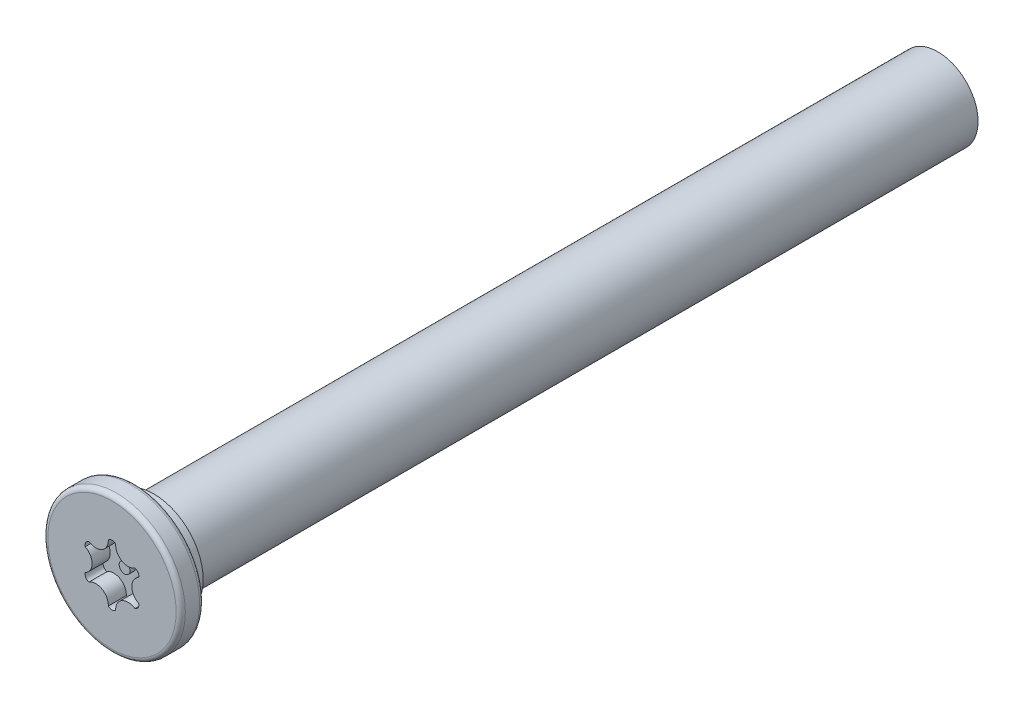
ISO-10303-21;
HEADER;
FILE_DESCRIPTION(('STEP AP214'),'2;1');
FILE_NAME('part.step','',(''),(''),'','','');
FILE_SCHEMA(('AUTOMOTIVE_DESIGN { 1 0 10303 214 1 1 1 1 }'));
ENDSEC;
DATA;
#1=APPLICATION_CONTEXT('core data for automotive mechanical design processes');
#2=APPLICATION_PROTOCOL_DEFINITION('international standard','automotive_design',2000,#1);
#3=PRODUCT_CONTEXT('',#1,'mechanical');
#4=PRODUCT('Part','Part','',(#3));
#5=PRODUCT_RELATED_PRODUCT_CATEGORY('part','',(#4));
#6=PRODUCT_DEFINITION_FORMATION('','',#4);
#7=PRODUCT_DEFINITION_CONTEXT('part definition',#1,'design');
#8=PRODUCT_DEFINITION('design','',#6,#7);
#9=PRODUCT_DEFINITION_SHAPE('','',#8);
#10=(LENGTH_UNIT() NAMED_UNIT(*) SI_UNIT(.MILLI.,.METRE.));
#11=(NAMED_UNIT(*) PLANE_ANGLE_UNIT() SI_UNIT($,.RADIAN.));
#12=(NAMED_UNIT(*) SI_UNIT($,.STERADIAN.) SOLID_ANGLE_UNIT());
#13=UNCERTAINTY_MEASURE_WITH_UNIT(LENGTH_MEASURE(1.E-05),#10,'distance_accuracy_value','');
#14=(GEOMETRIC_REPRESENTATION_CONTEXT(3) GLOBAL_UNCERTAINTY_ASSIGNED_CONTEXT((#13)) GLOBAL_UNIT_ASSIGNED_CONTEXT((#10,
#11,#12)) REPRESENTATION_CONTEXT('',''));
#15=CARTESIAN_POINT('',(0.,0.,0.));
#16=DIRECTION('',(0.,0.,1.));
#17=DIRECTION('',(1.,0.,0.));
#18=AXIS2_PLACEMENT_3D('',#15,#16,#17);
#19=CARTESIAN_POINT('',(0.,0.,0.));
#20=DIRECTION('',(0.,0.,1.));
#21=DIRECTION('',(1.,0.,0.));
#22=AXIS2_PLACEMENT_3D('',#19,#20,#21);
#23=PLANE('',#22);
#24=CARTESIAN_POINT('',(0.,0.,0.));
#25=DIRECTION('',(0.,0.,1.));
#26=DIRECTION('',(1.,0.,0.));
#27=AXIS2_PLACEMENT_3D('',#24,#25,#26);
#28=CIRCLE('',#27,3.55599999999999);
#29=CARTESIAN_POINT('',(3.55599999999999,0.,0.));
#30=VERTEX_POINT('',#29);
#31=EDGE_CURVE('E54',#30,#30,#28,.T.);
#32=ORIENTED_EDGE('',*,*,#31,.T.);
#33=EDGE_LOOP('',(#32));
#34=FACE_BOUND('',#33,.T.);
#35=CARTESIAN_POINT('',(0.893828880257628,1.54815703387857,0.));
#36=DIRECTION('',(0.,0.,1.));
#37=DIRECTION('',(1.,0.,0.));
#38=AXIS2_PLACEMENT_3D('',#35,#36,#37);
#39=CIRCLE('',#38,0.69);
#40=CARTESIAN_POINT('',(0.205060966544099,1.58937306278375,0.));
#41=VERTEX_POINT('',#40);
#42=CARTESIAN_POINT('',(1.27390696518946,0.972274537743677,0.));
#43=VERTEX_POINT('',#42);
#44=EDGE_CURVE('E181',#41,#43,#39,.T.);
#45=ORIENTED_EDGE('',*,*,#44,.T.);
#46=CARTESIAN_POINT('',(1.19884944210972,0.692156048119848,0.));
#47=DIRECTION('',(0.,0.,1.));
#48=DIRECTION('',(1.,0.,0.));
#49=AXIS2_PLACEMENT_3D('',#46,#47,#48);
#50=CIRCLE('',#49,0.29);
#51=CARTESIAN_POINT('',(1.47896793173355,0.617098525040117,0.));
#52=VERTEX_POINT('',#51);
#53=EDGE_CURVE('E61',#43,#52,#50,.F.);
#54=ORIENTED_EDGE('',*,*,#53,.T.);
#55=CARTESIAN_POINT('',(1.78765776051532,0.,0.));
#56=DIRECTION('',(0.,0.,1.));
#57=DIRECTION('',(1.,0.,0.));
#58=AXIS2_PLACEMENT_3D('',#55,#56,#57);
#59=CIRCLE('',#58,0.69);
#60=CARTESIAN_POINT('',(1.47896793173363,-0.617098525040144,0.));
#61=VERTEX_POINT('',#60);
#62=EDGE_CURVE('E111',#52,#61,#59,.T.);
#63=ORIENTED_EDGE('',*,*,#62,.T.);
#64=CARTESIAN_POINT('',(1.1988494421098,-0.692156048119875,0.));
#65=DIRECTION('',(0.,0.,1.));
#66=DIRECTION('',(1.,0.,0.));
#67=AXIS2_PLACEMENT_3D('',#64,#65,#66);
#68=CIRCLE('',#67,0.29);
#69=CARTESIAN_POINT('',(1.27390696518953,-0.972274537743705,0.));
#70=VERTEX_POINT('',#69);
#71=EDGE_CURVE('E216',#61,#70,#68,.F.);
#72=ORIENTED_EDGE('',*,*,#71,.T.);
#73=CARTESIAN_POINT('',(0.893828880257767,-1.54815703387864,0.));
#74=DIRECTION('',(0.,0.,1.));
#75=DIRECTION('',(1.,0.,0.));
#76=AXIS2_PLACEMENT_3D('',#73,#74,#75);
#77=CIRCLE('',#76,0.69);
#78=CARTESIAN_POINT('',(0.205060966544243,-1.5893730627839,0.));
#79=VERTEX_POINT('',#78);
#80=EDGE_CURVE('E160',#70,#79,#77,.T.);
#81=ORIENTED_EDGE('',*,*,#80,.T.);
#82=CARTESIAN_POINT('',(1.43067375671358E-13,-1.3843120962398,0.));
#83=DIRECTION('',(0.,0.,1.));
#84=DIRECTION('',(1.,0.,0.));
#85=AXIS2_PLACEMENT_3D('',#82,#83,#84);
#86=CIRCLE('',#85,0.29);
#87=CARTESIAN_POINT('',(-0.205060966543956,-1.5893730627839,0.));
#88=VERTEX_POINT('',#87);
#89=EDGE_CURVE('E210',#79,#88,#86,.F.);
#90=ORIENTED_EDGE('',*,*,#89,.T.);
#91=CARTESIAN_POINT('',(-0.893828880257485,-1.54815703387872,0.));
#92=DIRECTION('',(0.,0.,1.));
#93=DIRECTION('',(1.,0.,0.));
#94=AXIS2_PLACEMENT_3D('',#91,#92,#93);
#95=CIRCLE('',#94,0.69);
#96=CARTESIAN_POINT('',(-1.27390696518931,-0.97227453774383,0.));
#97=VERTEX_POINT('',#96);
#98=EDGE_CURVE('E206',#88,#97,#95,.T.);
#99=ORIENTED_EDGE('',*,*,#98,.T.);
#100=CARTESIAN_POINT('',(-1.19884944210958,-0.69215604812,0.));
#101=DIRECTION('',(0.,0.,1.));
#102=DIRECTION('',(1.,0.,0.));
#103=AXIS2_PLACEMENT_3D('',#100,#101,#102);
#104=CIRCLE('',#103,0.29);
#105=CARTESIAN_POINT('',(-1.47896793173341,-0.617098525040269,0.));
#106=VERTEX_POINT('',#105);
#107=EDGE_CURVE('E202',#97,#106,#104,.F.);
#108=ORIENTED_EDGE('',*,*,#107,.T.);
#109=CARTESIAN_POINT('',(-1.78765776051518,-1.56674837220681E-13,0.));
#110=DIRECTION('',(0.,0.,1.));
#111=DIRECTION('',(1.,0.,0.));
#112=AXIS2_PLACEMENT_3D('',#109,#110,#111);
#113=CIRCLE('',#112,0.69);
#114=CARTESIAN_POINT('',(-1.47896793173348,0.617098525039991,0.));
#115=VERTEX_POINT('',#114);
#116=EDGE_CURVE('E198',#106,#115,#113,.T.);
#117=ORIENTED_EDGE('',*,*,#116,.T.);
#118=CARTESIAN_POINT('',(-1.19884944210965,0.692156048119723,0.));
#119=DIRECTION('',(0.,0.,1.));
#120=DIRECTION('',(1.,0.,0.));
#121=AXIS2_PLACEMENT_3D('',#118,#119,#120);
#122=CIRCLE('',#121,0.29);
#123=CARTESIAN_POINT('',(-1.27390696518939,0.972274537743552,0.));
#124=VERTEX_POINT('',#123);
#125=EDGE_CURVE('E194',#115,#124,#122,.F.);
#126=ORIENTED_EDGE('',*,*,#125,.T.);
#127=CARTESIAN_POINT('',(-0.893828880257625,1.54815703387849,0.));
#128=DIRECTION('',(0.,0.,1.));
#129=DIRECTION('',(1.,0.,0.));
#130=AXIS2_PLACEMENT_3D('',#127,#128,#129);
#131=CIRCLE('',#130,0.690000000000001);
#132=CARTESIAN_POINT('',(-0.205060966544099,1.58937306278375,0.));
#133=VERTEX_POINT('',#132);
#134=EDGE_CURVE('E190',#124,#133,#131,.T.);
#135=ORIENTED_EDGE('',*,*,#134,.T.);
#136=CARTESIAN_POINT('',(0.,1.38431209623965,0.));
#137=DIRECTION('',(0.,0.,1.));
#138=DIRECTION('',(1.,0.,0.));
#139=AXIS2_PLACEMENT_3D('',#136,#137,#138);
#140=CIRCLE('',#139,0.29);
#141=EDGE_CURVE('E186',#133,#41,#140,.F.);
#142=ORIENTED_EDGE('',*,*,#141,.T.);
#143=EDGE_LOOP('',(#45,#54,#63,#72,#81,#90,#99,#108,#117,#126,#135,#142));
#144=FACE_BOUND('',#143,.T.);
#145=ADVANCED_FACE('F45',(#34,#144),#23,.T.);
#146=CARTESIAN_POINT('',(0.,0.,-1.3));
#147=DIRECTION('',(0.,0.,1.));
#148=DIRECTION('',(1.,0.,0.));
#149=AXIS2_PLACEMENT_3D('',#146,#147,#148);
#150=PLANE('',#149);
#151=CARTESIAN_POINT('',(0.,0.,-1.3));
#152=DIRECTION('',(0.,0.,1.));
#153=DIRECTION('',(1.,0.,0.));
#154=AXIS2_PLACEMENT_3D('',#151,#152,#153);
#155=CIRCLE('',#154,2.738000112);
#156=CARTESIAN_POINT('',(2.738000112,0.,-1.3));
#157=VERTEX_POINT('',#156);
#158=EDGE_CURVE('E11',#157,#157,#155,.F.);
#159=ORIENTED_EDGE('',*,*,#158,.F.);
#160=EDGE_LOOP('',(#159));
#161=FACE_BOUND('',#160,.T.);
#162=CARTESIAN_POINT('',(0.,0.,-1.3));
#163=DIRECTION('',(0.,0.,1.));
#164=DIRECTION('',(1.,0.,0.));
#165=AXIS2_PLACEMENT_3D('',#162,#163,#164);
#166=CIRCLE('',#165,3.55599999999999);
#167=CARTESIAN_POINT('',(3.55599999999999,0.,-1.3));
#168=VERTEX_POINT('',#167);
#169=EDGE_CURVE('E260',#168,#168,#166,.F.);
#170=ORIENTED_EDGE('',*,*,#169,.T.);
#171=EDGE_LOOP('',(#170));
#172=FACE_BOUND('',#171,.T.);
#173=ADVANCED_FACE('F283',(#161,#172),#150,.F.);
#174=CARTESIAN_POINT('',(0.,0.,-1.3));
#175=DIRECTION('',(0.,0.,1.));
#176=DIRECTION('',(1.,0.,0.));
#177=AXIS2_PLACEMENT_3D('',#174,#175,#176);
#178=CYLINDRICAL_SURFACE('',#177,3.80999999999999);
#179=CARTESIAN_POINT('',(0.,0.,-1.046));
#180=DIRECTION('',(0.,0.,1.));
#181=DIRECTION('',(1.,0.,0.));
#182=AXIS2_PLACEMENT_3D('',#179,#180,#181);
#183=CIRCLE('',#182,3.80999999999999);
#184=CARTESIAN_POINT('',(3.80999999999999,0.,-1.046));
#185=VERTEX_POINT('',#184);
#186=EDGE_CURVE('E256',#185,#185,#183,.T.);
#187=ORIENTED_EDGE('',*,*,#186,.T.);
#188=EDGE_LOOP('',(#187));
#189=FACE_BOUND('',#188,.T.);
#190=CARTESIAN_POINT('',(0.,0.,-0.254));
#191=DIRECTION('',(0.,0.,1.));
#192=DIRECTION('',(1.,0.,0.));
#193=AXIS2_PLACEMENT_3D('',#190,#191,#192);
#194=CIRCLE('',#193,3.80999999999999);
#195=CARTESIAN_POINT('',(3.80999999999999,0.,-0.254));
#196=VERTEX_POINT('',#195);
#197=EDGE_CURVE('E225',#196,#196,#194,.F.);
#198=ORIENTED_EDGE('',*,*,#197,.T.);
#199=EDGE_LOOP('',(#198));
#200=FACE_BOUND('',#199,.T.);
#201=ADVANCED_FACE('F289',(#189,#200),#178,.T.);
#202=CARTESIAN_POINT('',(1.19884944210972,0.692156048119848,-1.));
#203=DIRECTION('',(0.,0.,1.));
#204=DIRECTION('',(1.,0.,0.));
#205=AXIS2_PLACEMENT_3D('',#202,#203,#204);
#206=CYLINDRICAL_SURFACE('',#205,0.29);
#207=ORIENTED_EDGE('',*,*,#53,.F.);
#208=DIRECTION('',(0.,0.,1.));
#209=VECTOR('',#208,1.);
#210=CARTESIAN_POINT('',(1.27390696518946,0.972274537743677,-1.));
#211=LINE('',#210,#209);
#212=CARTESIAN_POINT('',(1.27390696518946,0.972274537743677,-1.));
#213=VERTEX_POINT('',#212);
#214=EDGE_CURVE('E178',#213,#43,#211,.T.);
#215=ORIENTED_EDGE('',*,*,#214,.F.);
#216=CARTESIAN_POINT('',(1.19884944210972,0.692156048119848,-1.));
#217=DIRECTION('',(0.,0.,1.));
#218=DIRECTION('',(1.,0.,0.));
#219=AXIS2_PLACEMENT_3D('',#216,#217,#218);
#220=CIRCLE('',#219,0.29);
#221=CARTESIAN_POINT('',(1.47896793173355,0.617098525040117,-1.));
#222=VERTEX_POINT('',#221);
#223=EDGE_CURVE('E221',#213,#222,#220,.F.);
#224=ORIENTED_EDGE('',*,*,#223,.T.);
#225=DIRECTION('',(0.,0.,1.));
#226=VECTOR('',#225,1.);
#227=CARTESIAN_POINT('',(1.47896793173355,0.617098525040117,-1.));
#228=LINE('',#227,#226);
#229=EDGE_CURVE('E222',#222,#52,#228,.T.);
#230=ORIENTED_EDGE('',*,*,#229,.T.);
#231=EDGE_LOOP('',(#207,#215,#224,#230));
#232=FACE_BOUND('',#231,.T.);
#233=ADVANCED_FACE('F294',(#232),#206,.F.);
#234=CARTESIAN_POINT('',(1.78765776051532,0.,-1.));
#235=DIRECTION('',(0.,0.,1.));
#236=DIRECTION('',(1.,0.,0.));
#237=AXIS2_PLACEMENT_3D('',#234,#235,#236);
#238=CYLINDRICAL_SURFACE('',#237,0.69);
#239=ORIENTED_EDGE('',*,*,#62,.F.);
#240=ORIENTED_EDGE('',*,*,#229,.F.);
#241=CARTESIAN_POINT('',(1.78765776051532,0.,-1.));
#242=DIRECTION('',(0.,0.,1.));
#243=DIRECTION('',(1.,0.,0.));
#244=AXIS2_PLACEMENT_3D('',#241,#242,#243);
#245=CIRCLE('',#244,0.69);
#246=CARTESIAN_POINT('',(1.47896793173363,-0.617098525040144,-1.));
#247=VERTEX_POINT('',#246);
#248=EDGE_CURVE('E70',#222,#247,#245,.T.);
#249=ORIENTED_EDGE('',*,*,#248,.T.);
#250=DIRECTION('',(0.,0.,1.));
#251=VECTOR('',#250,1.);
#252=CARTESIAN_POINT('',(1.47896793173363,-0.617098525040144,-1.));
#253=LINE('',#252,#251);
#254=EDGE_CURVE('E151',#247,#61,#253,.T.);
#255=ORIENTED_EDGE('',*,*,#254,.T.);
#256=EDGE_LOOP('',(#239,#240,#249,#255));
#257=FACE_BOUND('',#256,.T.);
#258=ADVANCED_FACE('F301',(#257),#238,.T.);
#259=CARTESIAN_POINT('',(1.1988494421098,-0.692156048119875,-1.));
#260=DIRECTION('',(0.,0.,1.));
#261=DIRECTION('',(1.,0.,0.));
#262=AXIS2_PLACEMENT_3D('',#259,#260,#261);
#263=CYLINDRICAL_SURFACE('',#262,0.29);
#264=ORIENTED_EDGE('',*,*,#71,.F.);
#265=ORIENTED_EDGE('',*,*,#254,.F.);
#266=CARTESIAN_POINT('',(1.1988494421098,-0.692156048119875,-1.));
#267=DIRECTION('',(0.,0.,1.));
#268=DIRECTION('',(1.,0.,0.));
#269=AXIS2_PLACEMENT_3D('',#266,#267,#268);
#270=CIRCLE('',#269,0.29);
#271=CARTESIAN_POINT('',(1.27390696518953,-0.972274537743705,-1.));
#272=VERTEX_POINT('',#271);
#273=EDGE_CURVE('E145',#247,#272,#270,.F.);
#274=ORIENTED_EDGE('',*,*,#273,.T.);
#275=DIRECTION('',(0.,0.,1.));
#276=VECTOR('',#275,1.);
#277=CARTESIAN_POINT('',(1.27390696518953,-0.972274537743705,-1.));
#278=LINE('',#277,#276);
#279=EDGE_CURVE('E149',#272,#70,#278,.T.);
#280=ORIENTED_EDGE('',*,*,#279,.T.);
#281=EDGE_LOOP('',(#264,#265,#274,#280));
#282=FACE_BOUND('',#281,.T.);
#283=ADVANCED_FACE('F148',(#282),#263,.F.);
#284=CARTESIAN_POINT('',(0.893828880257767,-1.54815703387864,-1.));
#285=DIRECTION('',(0.,0.,1.));
#286=DIRECTION('',(1.,0.,0.));
#287=AXIS2_PLACEMENT_3D('',#284,#285,#286);
#288=CYLINDRICAL_SURFACE('',#287,0.69);
#289=ORIENTED_EDGE('',*,*,#80,.F.);
#290=ORIENTED_EDGE('',*,*,#279,.F.);
#291=CARTESIAN_POINT('',(0.893828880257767,-1.54815703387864,-1.));
#292=DIRECTION('',(0.,0.,1.));
#293=DIRECTION('',(1.,0.,0.));
#294=AXIS2_PLACEMENT_3D('',#291,#292,#293);
#295=CIRCLE('',#294,0.69);
#296=CARTESIAN_POINT('',(0.205060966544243,-1.5893730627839,-1.));
#297=VERTEX_POINT('',#296);
#298=EDGE_CURVE('E154',#272,#297,#295,.T.);
#299=ORIENTED_EDGE('',*,*,#298,.T.);
#300=DIRECTION('',(0.,0.,1.));
#301=VECTOR('',#300,1.);
#302=CARTESIAN_POINT('',(0.205060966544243,-1.5893730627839,-1.));
#303=LINE('',#302,#301);
#304=EDGE_CURVE('E163',#297,#79,#303,.T.);
#305=ORIENTED_EDGE('',*,*,#304,.T.);
#306=EDGE_LOOP('',(#289,#290,#299,#305));
#307=FACE_BOUND('',#306,.T.);
#308=ADVANCED_FACE('F157',(#307),#288,.T.);
#309=CARTESIAN_POINT('',(1.43067375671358E-13,-1.3843120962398,-1.));
#310=DIRECTION('',(0.,0.,1.));
#311=DIRECTION('',(1.,0.,0.));
#312=AXIS2_PLACEMENT_3D('',#309,#310,#311);
#313=CYLINDRICAL_SURFACE('',#312,0.29);
#314=ORIENTED_EDGE('',*,*,#89,.F.);
#315=ORIENTED_EDGE('',*,*,#304,.F.);
#316=CARTESIAN_POINT('',(1.43067375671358E-13,-1.3843120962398,-1.));
#317=DIRECTION('',(0.,0.,1.));
#318=DIRECTION('',(1.,0.,0.));
#319=AXIS2_PLACEMENT_3D('',#316,#317,#318);
#320=CIRCLE('',#319,0.29);
#321=CARTESIAN_POINT('',(-0.205060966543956,-1.5893730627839,-1.));
#322=VERTEX_POINT('',#321);
#323=EDGE_CURVE('E168',#297,#322,#320,.F.);
#324=ORIENTED_EDGE('',*,*,#323,.T.);
#325=DIRECTION('',(0.,0.,1.));
#326=VECTOR('',#325,1.);
#327=CARTESIAN_POINT('',(-0.205060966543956,-1.5893730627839,-1.));
#328=LINE('',#327,#326);
#329=EDGE_CURVE('E230',#322,#88,#328,.T.);
#330=ORIENTED_EDGE('',*,*,#329,.T.);
#331=EDGE_LOOP('',(#314,#315,#324,#330));
#332=FACE_BOUND('',#331,.T.);
#333=ADVANCED_FACE('F318',(#332),#313,.F.);
#334=CARTESIAN_POINT('',(-0.893828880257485,-1.54815703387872,-1.));
#335=DIRECTION('',(0.,0.,1.));
#336=DIRECTION('',(1.,0.,0.));
#337=AXIS2_PLACEMENT_3D('',#334,#335,#336);
#338=CYLINDRICAL_SURFACE('',#337,0.69);
#339=ORIENTED_EDGE('',*,*,#98,.F.);
#340=ORIENTED_EDGE('',*,*,#329,.F.);
#341=CARTESIAN_POINT('',(-0.893828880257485,-1.54815703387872,-1.));
#342=DIRECTION('',(0.,0.,1.));
#343=DIRECTION('',(1.,0.,0.));
#344=AXIS2_PLACEMENT_3D('',#341,#342,#343);
#345=CIRCLE('',#344,0.69);
#346=CARTESIAN_POINT('',(-1.27390696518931,-0.97227453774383,-1.));
#347=VERTEX_POINT('',#346);
#348=EDGE_CURVE('E172',#322,#347,#345,.T.);
#349=ORIENTED_EDGE('',*,*,#348,.T.);
#350=DIRECTION('',(0.,0.,1.));
#351=VECTOR('',#350,1.);
#352=CARTESIAN_POINT('',(-1.27390696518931,-0.97227453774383,-1.));
#353=LINE('',#352,#351);
#354=EDGE_CURVE('E233',#347,#97,#353,.T.);
#355=ORIENTED_EDGE('',*,*,#354,.T.);
#356=EDGE_LOOP('',(#339,#340,#349,#355));
#357=FACE_BOUND('',#356,.T.);
#358=ADVANCED_FACE('F321',(#357),#338,.T.);
#359=CARTESIAN_POINT('',(-1.19884944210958,-0.69215604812,-1.));
#360=DIRECTION('',(0.,0.,1.));
#361=DIRECTION('',(1.,0.,0.));
#362=AXIS2_PLACEMENT_3D('',#359,#360,#361);
#363=CYLINDRICAL_SURFACE('',#362,0.29);
#364=ORIENTED_EDGE('',*,*,#107,.F.);
#365=ORIENTED_EDGE('',*,*,#354,.F.);
#366=CARTESIAN_POINT('',(-1.19884944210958,-0.69215604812,-1.));
#367=DIRECTION('',(0.,0.,1.));
#368=DIRECTION('',(1.,0.,0.));
#369=AXIS2_PLACEMENT_3D('',#366,#367,#368);
#370=CIRCLE('',#369,0.29);
#371=CARTESIAN_POINT('',(-1.47896793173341,-0.617098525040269,-1.));
#372=VERTEX_POINT('',#371);
#373=EDGE_CURVE('E374',#347,#372,#370,.F.);
#374=ORIENTED_EDGE('',*,*,#373,.T.);
#375=DIRECTION('',(0.,0.,1.));
#376=VECTOR('',#375,1.);
#377=CARTESIAN_POINT('',(-1.47896793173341,-0.617098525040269,-1.));
#378=LINE('',#377,#376);
#379=EDGE_CURVE('E236',#372,#106,#378,.T.);
#380=ORIENTED_EDGE('',*,*,#379,.T.);
#381=EDGE_LOOP('',(#364,#365,#374,#380));
#382=FACE_BOUND('',#381,.T.);
#383=ADVANCED_FACE('F325',(#382),#363,.F.);
#384=CARTESIAN_POINT('',(-1.78765776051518,-1.56674837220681E-13,-1.));
#385=DIRECTION('',(0.,0.,1.));
#386=DIRECTION('',(1.,0.,0.));
#387=AXIS2_PLACEMENT_3D('',#384,#385,#386);
#388=CYLINDRICAL_SURFACE('',#387,0.69);
#389=ORIENTED_EDGE('',*,*,#116,.F.);
#390=ORIENTED_EDGE('',*,*,#379,.F.);
#391=CARTESIAN_POINT('',(-1.78765776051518,-1.56674837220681E-13,-1.));
#392=DIRECTION('',(0.,0.,1.));
#393=DIRECTION('',(1.,0.,0.));
#394=AXIS2_PLACEMENT_3D('',#391,#392,#393);
#395=CIRCLE('',#394,0.69);
#396=CARTESIAN_POINT('',(-1.47896793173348,0.617098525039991,-1.));
#397=VERTEX_POINT('',#396);
#398=EDGE_CURVE('E371',#372,#397,#395,.T.);
#399=ORIENTED_EDGE('',*,*,#398,.T.);
#400=DIRECTION('',(0.,0.,1.));
#401=VECTOR('',#400,1.);
#402=CARTESIAN_POINT('',(-1.47896793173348,0.617098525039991,-1.));
#403=LINE('',#402,#401);
#404=EDGE_CURVE('E239',#397,#115,#403,.T.);
#405=ORIENTED_EDGE('',*,*,#404,.T.);
#406=EDGE_LOOP('',(#389,#390,#399,#405));
#407=FACE_BOUND('',#406,.T.);
#408=ADVANCED_FACE('F329',(#407),#388,.T.);
#409=CARTESIAN_POINT('',(-1.19884944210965,0.692156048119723,-1.));
#410=DIRECTION('',(0.,0.,1.));
#411=DIRECTION('',(1.,0.,0.));
#412=AXIS2_PLACEMENT_3D('',#409,#410,#411);
#413=CYLINDRICAL_SURFACE('',#412,0.29);
#414=ORIENTED_EDGE('',*,*,#125,.F.);
#415=ORIENTED_EDGE('',*,*,#404,.F.);
#416=CARTESIAN_POINT('',(-1.19884944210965,0.692156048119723,-1.));
#417=DIRECTION('',(0.,0.,1.));
#418=DIRECTION('',(1.,0.,0.));
#419=AXIS2_PLACEMENT_3D('',#416,#417,#418);
#420=CIRCLE('',#419,0.29);
#421=CARTESIAN_POINT('',(-1.27390696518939,0.972274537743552,-1.));
#422=VERTEX_POINT('',#421);
#423=EDGE_CURVE('E364',#397,#422,#420,.F.);
#424=ORIENTED_EDGE('',*,*,#423,.T.);
#425=DIRECTION('',(0.,0.,1.));
#426=VECTOR('',#425,1.);
#427=CARTESIAN_POINT('',(-1.27390696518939,0.972274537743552,-1.));
#428=LINE('',#427,#426);
#429=EDGE_CURVE('E242',#422,#124,#428,.T.);
#430=ORIENTED_EDGE('',*,*,#429,.T.);
#431=EDGE_LOOP('',(#414,#415,#424,#430));
#432=FACE_BOUND('',#431,.T.);
#433=ADVANCED_FACE('F333',(#432),#413,.F.);
#434=CARTESIAN_POINT('',(-0.893828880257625,1.54815703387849,-1.));
#435=DIRECTION('',(0.,0.,1.));
#436=DIRECTION('',(1.,0.,0.));
#437=AXIS2_PLACEMENT_3D('',#434,#435,#436);
#438=CYLINDRICAL_SURFACE('',#437,0.690000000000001);
#439=ORIENTED_EDGE('',*,*,#134,.F.);
#440=ORIENTED_EDGE('',*,*,#429,.F.);
#441=CARTESIAN_POINT('',(-0.893828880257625,1.54815703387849,-1.));
#442=DIRECTION('',(0.,0.,1.));
#443=DIRECTION('',(1.,0.,0.));
#444=AXIS2_PLACEMENT_3D('',#441,#442,#443);
#445=CIRCLE('',#444,0.690000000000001);
#446=CARTESIAN_POINT('',(-0.205060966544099,1.58937306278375,-1.));
#447=VERTEX_POINT('',#446);
#448=EDGE_CURVE('E360',#422,#447,#445,.T.);
#449=ORIENTED_EDGE('',*,*,#448,.T.);
#450=DIRECTION('',(0.,0.,1.));
#451=VECTOR('',#450,1.);
#452=CARTESIAN_POINT('',(-0.205060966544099,1.58937306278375,-1.));
#453=LINE('',#452,#451);
#454=EDGE_CURVE('E245',#447,#133,#453,.T.);
#455=ORIENTED_EDGE('',*,*,#454,.T.);
#456=EDGE_LOOP('',(#439,#440,#449,#455));
#457=FACE_BOUND('',#456,.T.);
#458=ADVANCED_FACE('F337',(#457),#438,.T.);
#459=CARTESIAN_POINT('',(0.,1.38431209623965,-1.));
#460=DIRECTION('',(0.,0.,1.));
#461=DIRECTION('',(1.,0.,0.));
#462=AXIS2_PLACEMENT_3D('',#459,#460,#461);
#463=CYLINDRICAL_SURFACE('',#462,0.29);
#464=ORIENTED_EDGE('',*,*,#141,.F.);
#465=ORIENTED_EDGE('',*,*,#454,.F.);
#466=CARTESIAN_POINT('',(0.,1.38431209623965,-1.));
#467=DIRECTION('',(0.,0.,1.));
#468=DIRECTION('',(1.,0.,0.));
#469=AXIS2_PLACEMENT_3D('',#466,#467,#468);
#470=CIRCLE('',#469,0.29);
#471=CARTESIAN_POINT('',(0.205060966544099,1.58937306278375,-1.));
#472=VERTEX_POINT('',#471);
#473=EDGE_CURVE('E357',#447,#472,#470,.F.);
#474=ORIENTED_EDGE('',*,*,#473,.T.);
#475=DIRECTION('',(0.,0.,1.));
#476=VECTOR('',#475,1.);
#477=CARTESIAN_POINT('',(0.205060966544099,1.58937306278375,-1.));
#478=LINE('',#477,#476);
#479=EDGE_CURVE('E248',#472,#41,#478,.T.);
#480=ORIENTED_EDGE('',*,*,#479,.T.);
#481=EDGE_LOOP('',(#464,#465,#474,#480));
#482=FACE_BOUND('',#481,.T.);
#483=ADVANCED_FACE('F341',(#482),#463,.F.);
#484=CARTESIAN_POINT('',(0.893828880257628,1.54815703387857,-1.));
#485=DIRECTION('',(0.,0.,1.));
#486=DIRECTION('',(1.,0.,0.));
#487=AXIS2_PLACEMENT_3D('',#484,#485,#486);
#488=CYLINDRICAL_SURFACE('',#487,0.69);
#489=ORIENTED_EDGE('',*,*,#44,.F.);
#490=ORIENTED_EDGE('',*,*,#479,.F.);
#491=CARTESIAN_POINT('',(0.893828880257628,1.54815703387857,-1.));
#492=DIRECTION('',(0.,0.,1.));
#493=DIRECTION('',(1.,0.,0.));
#494=AXIS2_PLACEMENT_3D('',#491,#492,#493);
#495=CIRCLE('',#494,0.69);
#496=EDGE_CURVE('E118',#472,#213,#495,.T.);
#497=ORIENTED_EDGE('',*,*,#496,.T.);
#498=ORIENTED_EDGE('',*,*,#214,.T.);
#499=EDGE_LOOP('',(#489,#490,#497,#498));
#500=FACE_BOUND('',#499,.T.);
#501=ADVANCED_FACE('F344',(#500),#488,.T.);
#502=CARTESIAN_POINT('',(0.,0.,-1.));
#503=DIRECTION('',(0.,0.,1.));
#504=DIRECTION('',(1.,0.,0.));
#505=AXIS2_PLACEMENT_3D('',#502,#503,#504);
#506=PLANE('',#505);
#507=CARTESIAN_POINT('',(0.,0.,-1.));
#508=DIRECTION('',(0.,0.,1.));
#509=DIRECTION('',(1.,0.,0.));
#510=AXIS2_PLACEMENT_3D('',#507,#508,#509);
#511=CIRCLE('',#510,0.3);
#512=CARTESIAN_POINT('',(0.3,0.,-1.));
#513=VERTEX_POINT('',#512);
#514=EDGE_CURVE('E396',#513,#513,#511,.T.);
#515=ORIENTED_EDGE('',*,*,#514,.F.);
#516=EDGE_LOOP('',(#515));
#517=FACE_BOUND('',#516,.T.);
#518=ORIENTED_EDGE('',*,*,#223,.F.);
#519=ORIENTED_EDGE('',*,*,#496,.F.);
#520=ORIENTED_EDGE('',*,*,#473,.F.);
#521=ORIENTED_EDGE('',*,*,#448,.F.);
#522=ORIENTED_EDGE('',*,*,#423,.F.);
#523=ORIENTED_EDGE('',*,*,#398,.F.);
#524=ORIENTED_EDGE('',*,*,#373,.F.);
#525=ORIENTED_EDGE('',*,*,#348,.F.);
#526=ORIENTED_EDGE('',*,*,#323,.F.);
#527=ORIENTED_EDGE('',*,*,#298,.F.);
#528=ORIENTED_EDGE('',*,*,#273,.F.);
#529=ORIENTED_EDGE('',*,*,#248,.F.);
#530=EDGE_LOOP('',(#518,#519,#520,#521,#522,#523,#524,#525,#526,#527,#528,#529));
#531=FACE_BOUND('',#530,.T.);
#532=ADVANCED_FACE('F166',(#517,#531),#506,.T.);
#533=CARTESIAN_POINT('',(0.,0.,-1.046));
#534=DIRECTION('',(0.,0.,1.));
#535=DIRECTION('',(1.,0.,0.));
#536=AXIS2_PLACEMENT_3D('',#533,#534,#535);
#537=TOROIDAL_SURFACE('',#536,3.55599999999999,0.254);
#538=ORIENTED_EDGE('',*,*,#169,.F.);
#539=EDGE_LOOP('',(#538));
#540=FACE_BOUND('',#539,.T.);
#541=ORIENTED_EDGE('',*,*,#186,.F.);
#542=EDGE_LOOP('',(#541));
#543=FACE_BOUND('',#542,.T.);
#544=ADVANCED_FACE('F271',(#540,#543),#537,.T.);
#545=CARTESIAN_POINT('',(0.,0.,-0.254));
#546=DIRECTION('',(0.,0.,1.));
#547=DIRECTION('',(1.,0.,0.));
#548=AXIS2_PLACEMENT_3D('',#545,#546,#547);
#549=TOROIDAL_SURFACE('',#548,3.55599999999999,0.254);
#550=ORIENTED_EDGE('',*,*,#197,.F.);
#551=EDGE_LOOP('',(#550));
#552=FACE_BOUND('',#551,.T.);
#553=ORIENTED_EDGE('',*,*,#31,.F.);
#554=EDGE_LOOP('',(#553));
#555=FACE_BOUND('',#554,.T.);
#556=ADVANCED_FACE('F47',(#552,#555),#549,.T.);
#557=CARTESIAN_POINT('',(0.,0.,-2.316));
#558=DIRECTION('',(0.,0.,-1.));
#559=DIRECTION('',(-1.,0.,0.));
#560=AXIS2_PLACEMENT_3D('',#557,#558,#559);
#561=PLANE('',#560);
#562=CARTESIAN_POINT('',(0.,0.,-2.316));
#563=DIRECTION('',(0.,0.,-1.));
#564=DIRECTION('',(-1.,0.,0.));
#565=AXIS2_PLACEMENT_3D('',#562,#563,#564);
#566=CIRCLE('',#565,2.738000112);
#567=CARTESIAN_POINT('',(-2.738000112,0.,-2.316));
#568=VERTEX_POINT('',#567);
#569=EDGE_CURVE('E182',#568,#568,#566,.T.);
#570=ORIENTED_EDGE('',*,*,#569,.T.);
#571=EDGE_LOOP('',(#570));
#572=FACE_BOUND('',#571,.T.);
#573=CARTESIAN_POINT('',(0.,0.,-2.316));
#574=DIRECTION('',(0.,0.,-1.));
#575=DIRECTION('',(-1.,0.,0.));
#576=AXIS2_PLACEMENT_3D('',#573,#574,#575);
#577=CIRCLE('',#576,2.230000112);
#578=CARTESIAN_POINT('',(-2.230000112,0.,-2.316));
#579=VERTEX_POINT('',#578);
#580=EDGE_CURVE('E400',#579,#579,#577,.T.);
#581=ORIENTED_EDGE('',*,*,#580,.F.);
#582=EDGE_LOOP('',(#581));
#583=FACE_BOUND('',#582,.T.);
#584=ADVANCED_FACE('F270',(#572,#583),#561,.T.);
#585=CARTESIAN_POINT('',(0.,0.,-2.316));
#586=DIRECTION('',(0.,0.,1.));
#587=DIRECTION('',(1.,0.,0.));
#588=AXIS2_PLACEMENT_3D('',#585,#586,#587);
#589=CYLINDRICAL_SURFACE('',#588,2.738000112);
#590=ORIENTED_EDGE('',*,*,#569,.F.);
#591=EDGE_LOOP('',(#590));
#592=FACE_BOUND('',#591,.T.);
#593=ORIENTED_EDGE('',*,*,#158,.T.);
#594=EDGE_LOOP('',(#593));
#595=FACE_BOUND('',#594,.T.);
#596=ADVANCED_FACE('F277',(#592,#595),#589,.T.);
#597=CARTESIAN_POINT('',(0.,0.,-0.7));
#598=DIRECTION('',(0.,0.,-1.));
#599=DIRECTION('',(-1.,0.,0.));
#600=AXIS2_PLACEMENT_3D('',#597,#598,#599);
#601=CYLINDRICAL_SURFACE('',#600,0.3);
#602=CARTESIAN_POINT('',(0.,0.,-0.7));
#603=DIRECTION('',(0.,0.,1.));
#604=DIRECTION('',(1.,0.,0.));
#605=AXIS2_PLACEMENT_3D('',#602,#603,#604);
#606=CIRCLE('',#605,0.3);
#607=CARTESIAN_POINT('',(0.3,0.,-0.7));
#608=VERTEX_POINT('',#607);
#609=EDGE_CURVE('E395',#608,#608,#606,.T.);
#610=ORIENTED_EDGE('',*,*,#609,.F.);
#611=EDGE_LOOP('',(#610));
#612=FACE_BOUND('',#611,.T.);
#613=ORIENTED_EDGE('',*,*,#514,.T.);
#614=EDGE_LOOP('',(#613));
#615=FACE_BOUND('',#614,.T.);
#616=ADVANCED_FACE('F424',(#612,#615),#601,.T.);
#617=CARTESIAN_POINT('',(0.,0.,-0.7));
#618=DIRECTION('',(0.,0.,1.));
#619=DIRECTION('',(1.,0.,0.));
#620=AXIS2_PLACEMENT_3D('',#617,#618,#619);
#621=PLANE('',#620);
#622=ORIENTED_EDGE('',*,*,#609,.T.);
#623=EDGE_LOOP('',(#622));
#624=FACE_BOUND('',#623,.T.);
#625=ADVANCED_FACE('F416',(#624),#621,.T.);
#626=CARTESIAN_POINT('',(0.,0.,-45.75));
#627=DIRECTION('',(0.,0.,1.));
#628=DIRECTION('',(1.,0.,0.));
#629=AXIS2_PLACEMENT_3D('',#626,#627,#628);
#630=CYLINDRICAL_SURFACE('',#629,2.230000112);
#631=ORIENTED_EDGE('',*,*,#580,.T.);
#632=EDGE_LOOP('',(#631));
#633=FACE_BOUND('',#632,.T.);
#634=CARTESIAN_POINT('',(0.,0.,-45.75));
#635=DIRECTION('',(0.,0.,-1.));
#636=DIRECTION('',(-1.,0.,0.));
#637=AXIS2_PLACEMENT_3D('',#634,#635,#636);
#638=CIRCLE('',#637,2.230000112);
#639=CARTESIAN_POINT('',(-2.230000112,0.,-45.75));
#640=VERTEX_POINT('',#639);
#641=EDGE_CURVE('E407',#640,#640,#638,.T.);
#642=ORIENTED_EDGE('',*,*,#641,.F.);
#643=EDGE_LOOP('',(#642));
#644=FACE_BOUND('',#643,.T.);
#645=ADVANCED_FACE('F414',(#633,#644),#630,.T.);
#646=CARTESIAN_POINT('',(0.,0.,-45.75));
#647=DIRECTION('',(0.,0.,-1.));
#648=DIRECTION('',(-1.,0.,0.));
#649=AXIS2_PLACEMENT_3D('',#646,#647,#648);
#650=PLANE('',#649);
#651=ORIENTED_EDGE('',*,*,#641,.T.);
#652=EDGE_LOOP('',(#651));
#653=FACE_BOUND('',#652,.T.);
#654=ADVANCED_FACE('F412',(#653),#650,.T.);
#655=CLOSED_SHELL('',(#145,#173,#201,#233,#258,#283,#308,#333,#358,#383,#408,#433,#458,#483,
#501,#532,#544,#556,#584,#596,#616,#625,#645,#654));
#656=MANIFOLD_SOLID_BREP('B2',#655);
#657=ADVANCED_BREP_SHAPE_REPRESENTATION('',(#18,#656),#14);
#658=SHAPE_DEFINITION_REPRESENTATION(#9,#657);
ENDSEC;
END-ISO-10303-21;
